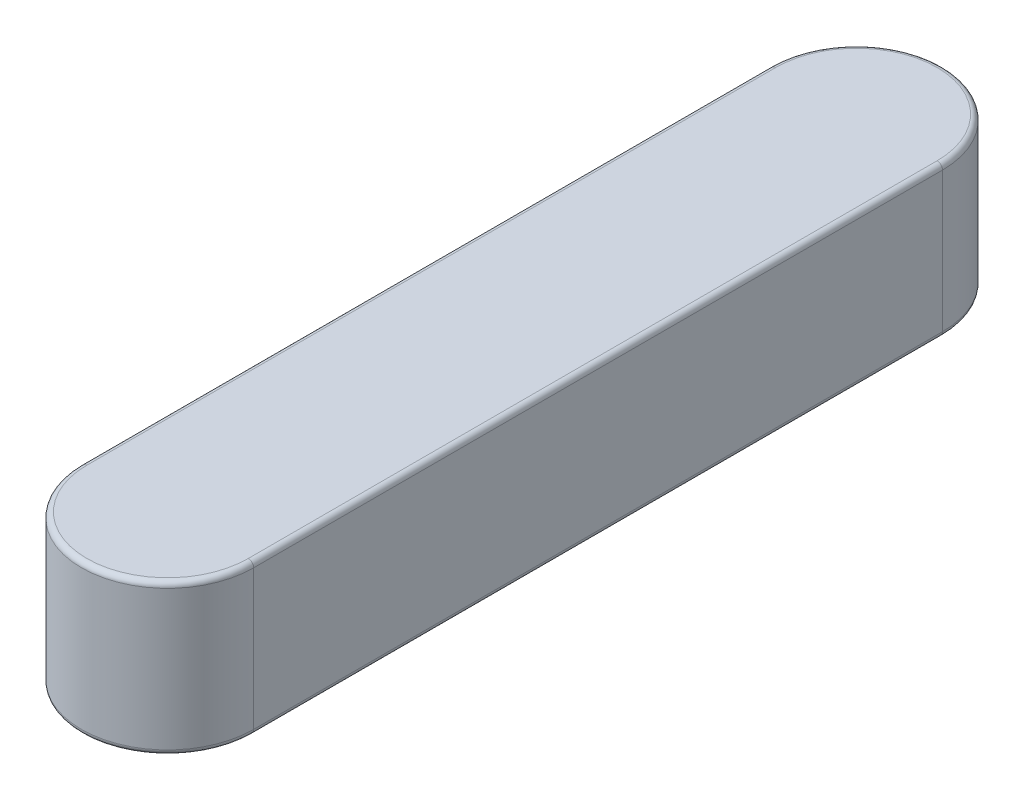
from build123d import *

# Parameters (mm, degrees)
EXTRUSION1_DEPTH = 7
CONG_1_R         = 0.25


with BuildPart() as part:
    # Esquisse1 → Extrusion1 (new body)
    with BuildSketch(Plane(origin=(0, 0, 0), x_dir=(1, 0, 0), z_dir=(0, 1, 0))):
        with BuildLine():
            Line((4, 32), (4, 0))
            ThreePointArc((4, 0), (0, -4), (-4, 0))
            Line((-4, 0), (-4, 32))
            ThreePointArc((-4, 32), (0, 36), (4, 32))
        make_face()
    extrude(amount=EXTRUSION1_DEPTH)

    # Cong_1
    cong_1_edges = [part.edges().sort_by_distance(p)[0] for p in [
        (0, 7, 4),
        (4, 7, -16),
        (0, 7, -36),
        (4, 0, -16),
        (0, 0, 4),
        (-4, 0, -16),
        (0, 0, -36),
        (-4, 7, -16),
    ]]
    fillet(cong_1_edges, radius=CONG_1_R)


solid = part.part
